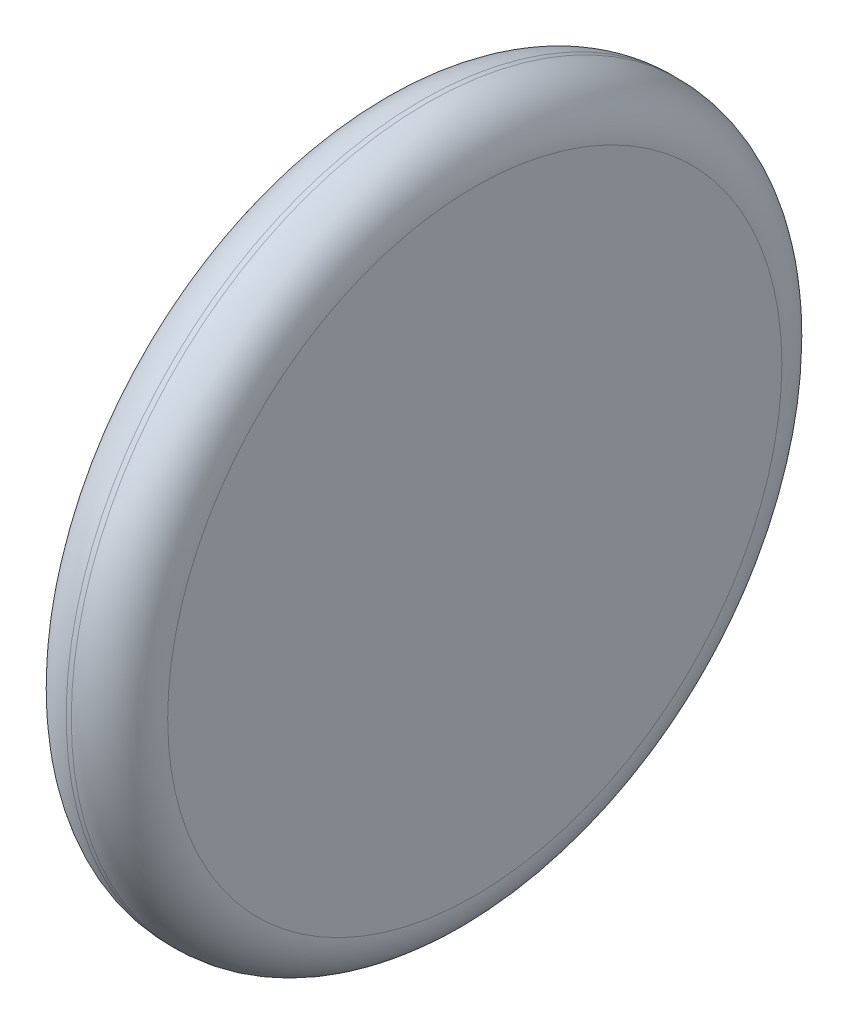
ISO-10303-21;
HEADER;
FILE_DESCRIPTION(('STEP AP214'),'2;1');
FILE_NAME('part.step','',(''),(''),'','','');
FILE_SCHEMA(('AUTOMOTIVE_DESIGN { 1 0 10303 214 1 1 1 1 }'));
ENDSEC;
DATA;
#1=APPLICATION_CONTEXT('core data for automotive mechanical design processes');
#2=APPLICATION_PROTOCOL_DEFINITION('international standard','automotive_design',2000,#1);
#3=PRODUCT_CONTEXT('',#1,'mechanical');
#4=PRODUCT('Part','Part','',(#3));
#5=PRODUCT_RELATED_PRODUCT_CATEGORY('part','',(#4));
#6=PRODUCT_DEFINITION_FORMATION('','',#4);
#7=PRODUCT_DEFINITION_CONTEXT('part definition',#1,'design');
#8=PRODUCT_DEFINITION('design','',#6,#7);
#9=PRODUCT_DEFINITION_SHAPE('','',#8);
#10=(LENGTH_UNIT() NAMED_UNIT(*) SI_UNIT(.MILLI.,.METRE.));
#11=(NAMED_UNIT(*) PLANE_ANGLE_UNIT() SI_UNIT($,.RADIAN.));
#12=(NAMED_UNIT(*) SI_UNIT($,.STERADIAN.) SOLID_ANGLE_UNIT());
#13=UNCERTAINTY_MEASURE_WITH_UNIT(LENGTH_MEASURE(1.E-05),#10,'distance_accuracy_value','');
#14=(GEOMETRIC_REPRESENTATION_CONTEXT(3) GLOBAL_UNCERTAINTY_ASSIGNED_CONTEXT((#13)) GLOBAL_UNIT_ASSIGNED_CONTEXT((#10,
#11,#12)) REPRESENTATION_CONTEXT('',''));
#15=CARTESIAN_POINT('',(0.,0.,0.));
#16=DIRECTION('',(0.,0.,1.));
#17=DIRECTION('',(1.,0.,0.));
#18=AXIS2_PLACEMENT_3D('',#15,#16,#17);
#19=CARTESIAN_POINT('',(0.1999996,1.39447778,0.));
#20=DIRECTION('',(-1.,0.,0.));
#21=DIRECTION('',(0.,0.,1.));
#22=AXIS2_PLACEMENT_3D('',#19,#20,#21);
#23=PLANE('',#22);
#24=CARTESIAN_POINT('',(0.1999996,-0.005521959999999,0.));
#25=DIRECTION('',(-1.,0.,0.));
#26=DIRECTION('',(0.,1.,0.));
#27=AXIS2_PLACEMENT_3D('',#24,#25,#26);
#28=CIRCLE('',#27,1.20999974);
#29=CARTESIAN_POINT('',(0.1999996,1.20447778,0.));
#30=VERTEX_POINT('',#29);
#31=EDGE_CURVE('E34',#30,#30,#28,.T.);
#32=ORIENTED_EDGE('',*,*,#31,.F.);
#33=EDGE_LOOP('',(#32));
#34=FACE_BOUND('',#33,.T.);
#35=ADVANCED_FACE('F15',(#34),#23,.F.);
#36=CARTESIAN_POINT('',(0.0099996,-0.005521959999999,0.));
#37=DIRECTION('',(1.,0.,0.));
#38=DIRECTION('',(0.,1.,0.));
#39=AXIS2_PLACEMENT_3D('',#36,#37,#38);
#40=TOROIDAL_SURFACE('',#39,1.20999974,0.19);
#41=CARTESIAN_POINT('',(0.0099996,-0.005521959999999,0.));
#42=DIRECTION('',(-1.,0.,0.));
#43=DIRECTION('',(0.,0.,1.));
#44=AXIS2_PLACEMENT_3D('',#41,#42,#43);
#45=CIRCLE('',#44,1.39999974);
#46=CARTESIAN_POINT('',(0.0099996,-0.005521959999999,1.39999974));
#47=VERTEX_POINT('',#46);
#48=EDGE_CURVE('E29',#47,#47,#45,.T.);
#49=ORIENTED_EDGE('',*,*,#48,.F.);
#50=EDGE_LOOP('',(#49));
#51=FACE_BOUND('',#50,.T.);
#52=ORIENTED_EDGE('',*,*,#31,.T.);
#53=EDGE_LOOP('',(#52));
#54=FACE_BOUND('',#53,.T.);
#55=ADVANCED_FACE('F60',(#51,#54),#40,.T.);
#56=CARTESIAN_POINT('',(-0.1999996,-0.005521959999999,0.));
#57=DIRECTION('',(-1.,0.,0.));
#58=DIRECTION('',(0.,0.,1.));
#59=AXIS2_PLACEMENT_3D('',#56,#57,#58);
#60=CYLINDRICAL_SURFACE('',#59,1.39999974);
#61=CARTESIAN_POINT('',(-0.0099996,-0.005521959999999,0.));
#62=DIRECTION('',(-1.,0.,0.));
#63=DIRECTION('',(0.,1.,0.));
#64=AXIS2_PLACEMENT_3D('',#61,#62,#63);
#65=CIRCLE('',#64,1.39999974);
#66=CARTESIAN_POINT('',(-0.0099996,1.39447778,0.));
#67=VERTEX_POINT('',#66);
#68=EDGE_CURVE('E24',#67,#67,#65,.T.);
#69=ORIENTED_EDGE('',*,*,#68,.F.);
#70=EDGE_LOOP('',(#69));
#71=FACE_BOUND('',#70,.T.);
#72=ORIENTED_EDGE('',*,*,#48,.T.);
#73=EDGE_LOOP('',(#72));
#74=FACE_BOUND('',#73,.T.);
#75=ADVANCED_FACE('F57',(#71,#74),#60,.T.);
#76=CARTESIAN_POINT('',(-0.0099996,-0.005521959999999,0.));
#77=DIRECTION('',(-1.,0.,0.));
#78=DIRECTION('',(0.,1.,0.));
#79=AXIS2_PLACEMENT_3D('',#76,#77,#78);
#80=TOROIDAL_SURFACE('',#79,1.20999974,0.19);
#81=ORIENTED_EDGE('',*,*,#68,.T.);
#82=EDGE_LOOP('',(#81));
#83=FACE_BOUND('',#82,.T.);
#84=CARTESIAN_POINT('',(-0.1999996,-0.005521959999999,0.));
#85=DIRECTION('',(1.,0.,0.));
#86=DIRECTION('',(0.,1.,0.));
#87=AXIS2_PLACEMENT_3D('',#84,#85,#86);
#88=CIRCLE('',#87,1.20999974);
#89=CARTESIAN_POINT('',(-0.1999996,1.20447778,0.));
#90=VERTEX_POINT('',#89);
#91=EDGE_CURVE('E10',#90,#90,#88,.F.);
#92=ORIENTED_EDGE('',*,*,#91,.F.);
#93=EDGE_LOOP('',(#92));
#94=FACE_BOUND('',#93,.T.);
#95=ADVANCED_FACE('F46',(#83,#94),#80,.T.);
#96=CARTESIAN_POINT('',(-0.1999996,1.39447778,0.));
#97=DIRECTION('',(-1.,0.,0.));
#98=DIRECTION('',(0.,0.,1.));
#99=AXIS2_PLACEMENT_3D('',#96,#97,#98);
#100=PLANE('',#99);
#101=ORIENTED_EDGE('',*,*,#91,.T.);
#102=EDGE_LOOP('',(#101));
#103=FACE_BOUND('',#102,.T.);
#104=ADVANCED_FACE('F56',(#103),#100,.T.);
#105=CLOSED_SHELL('',(#35,#55,#75,#95,#104));
#106=MANIFOLD_SOLID_BREP('B1',#105);
#107=ADVANCED_BREP_SHAPE_REPRESENTATION('',(#18,#106),#14);
#108=SHAPE_DEFINITION_REPRESENTATION(#9,#107);
ENDSEC;
END-ISO-10303-21;
